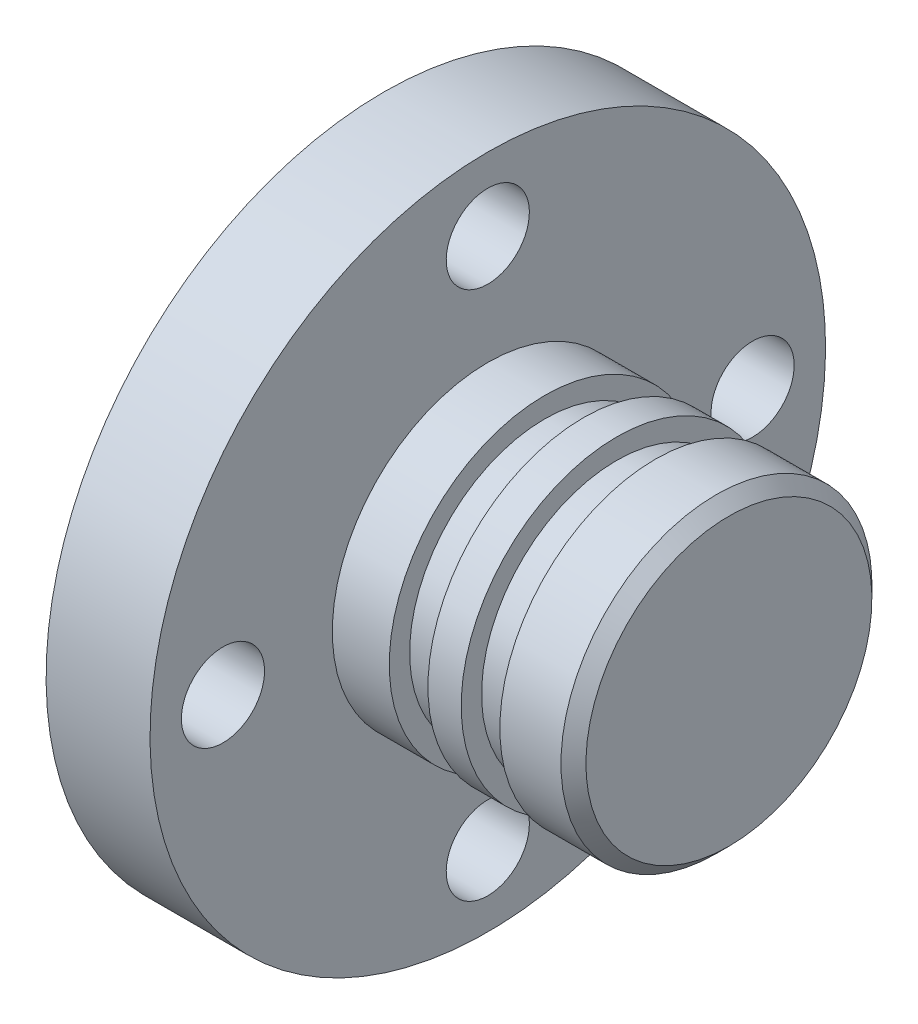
ISO-10303-21;
HEADER;
FILE_DESCRIPTION(('STEP AP214'),'2;1');
FILE_NAME('part.step','',(''),(''),'','','');
FILE_SCHEMA(('AUTOMOTIVE_DESIGN { 1 0 10303 214 1 1 1 1 }'));
ENDSEC;
DATA;
#1=APPLICATION_CONTEXT('core data for automotive mechanical design processes');
#2=APPLICATION_PROTOCOL_DEFINITION('international standard','automotive_design',2000,#1);
#3=PRODUCT_CONTEXT('',#1,'mechanical');
#4=PRODUCT('Part','Part','',(#3));
#5=PRODUCT_RELATED_PRODUCT_CATEGORY('part','',(#4));
#6=PRODUCT_DEFINITION_FORMATION('','',#4);
#7=PRODUCT_DEFINITION_CONTEXT('part definition',#1,'design');
#8=PRODUCT_DEFINITION('design','',#6,#7);
#9=PRODUCT_DEFINITION_SHAPE('','',#8);
#10=(LENGTH_UNIT() NAMED_UNIT(*) SI_UNIT(.MILLI.,.METRE.));
#11=(NAMED_UNIT(*) PLANE_ANGLE_UNIT() SI_UNIT($,.RADIAN.));
#12=(NAMED_UNIT(*) SI_UNIT($,.STERADIAN.) SOLID_ANGLE_UNIT());
#13=UNCERTAINTY_MEASURE_WITH_UNIT(LENGTH_MEASURE(1.E-05),#10,'distance_accuracy_value','');
#14=(GEOMETRIC_REPRESENTATION_CONTEXT(3) GLOBAL_UNCERTAINTY_ASSIGNED_CONTEXT((#13)) GLOBAL_UNIT_ASSIGNED_CONTEXT((#10,
#11,#12)) REPRESENTATION_CONTEXT('',''));
#15=CARTESIAN_POINT('',(0.,0.,0.));
#16=DIRECTION('',(0.,0.,1.));
#17=DIRECTION('',(1.,0.,0.));
#18=AXIS2_PLACEMENT_3D('',#15,#16,#17);
#19=CARTESIAN_POINT('',(0.,0.,0.));
#20=DIRECTION('',(1.,0.,0.));
#21=DIRECTION('',(0.,1.,0.));
#22=AXIS2_PLACEMENT_3D('',#19,#20,#21);
#23=CYLINDRICAL_SURFACE('',#22,9.4996);
#24=CARTESIAN_POINT('',(9.8298,0.,0.));
#25=DIRECTION('',(1.,0.,0.));
#26=DIRECTION('',(0.,1.,0.));
#27=AXIS2_PLACEMENT_3D('',#24,#25,#26);
#28=CIRCLE('',#27,9.4996);
#29=CARTESIAN_POINT('',(9.8298,9.4996,0.));
#30=VERTEX_POINT('',#29);
#31=EDGE_CURVE('E389',#30,#30,#28,.T.);
#32=ORIENTED_EDGE('',*,*,#31,.F.);
#33=EDGE_LOOP('',(#32));
#34=FACE_BOUND('',#33,.T.);
#35=CARTESIAN_POINT('',(6.35,0.,0.));
#36=DIRECTION('',(1.,0.,0.));
#37=DIRECTION('',(0.,1.,0.));
#38=AXIS2_PLACEMENT_3D('',#35,#36,#37);
#39=CIRCLE('',#38,9.4996);
#40=CARTESIAN_POINT('',(6.35,9.4996,0.));
#41=VERTEX_POINT('',#40);
#42=EDGE_CURVE('E411',#41,#41,#39,.T.);
#43=ORIENTED_EDGE('',*,*,#42,.T.);
#44=EDGE_LOOP('',(#43));
#45=FACE_BOUND('',#44,.T.);
#46=ADVANCED_FACE('F379',(#34,#45),#23,.T.);
#47=CARTESIAN_POINT('',(9.8298,-9.4996,0.));
#48=DIRECTION('',(-1.,0.,0.));
#49=DIRECTION('',(0.,-1.,0.));
#50=AXIS2_PLACEMENT_3D('',#47,#48,#49);
#51=PLANE('',#50);
#52=CARTESIAN_POINT('',(9.8298,0.,0.));
#53=DIRECTION('',(1.,0.,0.));
#54=DIRECTION('',(0.,1.,0.));
#55=AXIS2_PLACEMENT_3D('',#52,#53,#54);
#56=CIRCLE('',#55,8.255);
#57=CARTESIAN_POINT('',(9.8298,8.255,0.));
#58=VERTEX_POINT('',#57);
#59=EDGE_CURVE('E393',#58,#58,#56,.T.);
#60=ORIENTED_EDGE('',*,*,#59,.F.);
#61=EDGE_LOOP('',(#60));
#62=FACE_BOUND('',#61,.T.);
#63=ORIENTED_EDGE('',*,*,#31,.T.);
#64=EDGE_LOOP('',(#63));
#65=FACE_BOUND('',#64,.T.);
#66=ADVANCED_FACE('F481',(#62,#65),#51,.F.);
#67=CARTESIAN_POINT('',(0.,0.,0.));
#68=DIRECTION('',(1.,0.,0.));
#69=DIRECTION('',(0.,1.,0.));
#70=AXIS2_PLACEMENT_3D('',#67,#68,#69);
#71=CYLINDRICAL_SURFACE('',#70,8.255);
#72=CARTESIAN_POINT('',(12.192,0.,0.));
#73=DIRECTION('',(1.,0.,0.));
#74=DIRECTION('',(0.,1.,0.));
#75=AXIS2_PLACEMENT_3D('',#72,#73,#74);
#76=CIRCLE('',#75,8.255);
#77=CARTESIAN_POINT('',(12.192,8.255,0.));
#78=VERTEX_POINT('',#77);
#79=EDGE_CURVE('E415',#78,#78,#76,.T.);
#80=ORIENTED_EDGE('',*,*,#79,.F.);
#81=EDGE_LOOP('',(#80));
#82=FACE_BOUND('',#81,.T.);
#83=ORIENTED_EDGE('',*,*,#59,.T.);
#84=EDGE_LOOP('',(#83));
#85=FACE_BOUND('',#84,.T.);
#86=ADVANCED_FACE('F486',(#82,#85),#71,.T.);
#87=CARTESIAN_POINT('',(12.192,-8.255,0.));
#88=DIRECTION('',(1.,0.,0.));
#89=DIRECTION('',(0.,1.,0.));
#90=AXIS2_PLACEMENT_3D('',#87,#88,#89);
#91=PLANE('',#90);
#92=CARTESIAN_POINT('',(12.192,0.,0.));
#93=DIRECTION('',(1.,0.,0.));
#94=DIRECTION('',(0.,1.,0.));
#95=AXIS2_PLACEMENT_3D('',#92,#93,#94);
#96=CIRCLE('',#95,9.4996);
#97=CARTESIAN_POINT('',(12.192,9.4996,0.));
#98=VERTEX_POINT('',#97);
#99=EDGE_CURVE('E418',#98,#98,#96,.T.);
#100=ORIENTED_EDGE('',*,*,#99,.F.);
#101=EDGE_LOOP('',(#100));
#102=FACE_BOUND('',#101,.T.);
#103=ORIENTED_EDGE('',*,*,#79,.T.);
#104=EDGE_LOOP('',(#103));
#105=FACE_BOUND('',#104,.T.);
#106=ADVANCED_FACE('F497',(#102,#105),#91,.F.);
#107=CARTESIAN_POINT('',(0.,0.,0.));
#108=DIRECTION('',(1.,0.,0.));
#109=DIRECTION('',(0.,1.,0.));
#110=AXIS2_PLACEMENT_3D('',#107,#108,#109);
#111=CYLINDRICAL_SURFACE('',#110,9.4996);
#112=CARTESIAN_POINT('',(14.224,0.,0.));
#113=DIRECTION('',(1.,0.,0.));
#114=DIRECTION('',(0.,1.,0.));
#115=AXIS2_PLACEMENT_3D('',#112,#113,#114);
#116=CIRCLE('',#115,9.4996);
#117=CARTESIAN_POINT('',(14.224,9.4996,0.));
#118=VERTEX_POINT('',#117);
#119=EDGE_CURVE('E421',#118,#118,#116,.T.);
#120=ORIENTED_EDGE('',*,*,#119,.F.);
#121=EDGE_LOOP('',(#120));
#122=FACE_BOUND('',#121,.T.);
#123=ORIENTED_EDGE('',*,*,#99,.T.);
#124=EDGE_LOOP('',(#123));
#125=FACE_BOUND('',#124,.T.);
#126=ADVANCED_FACE('F504',(#122,#125),#111,.T.);
#127=CARTESIAN_POINT('',(14.224,-9.4996,0.));
#128=DIRECTION('',(-1.,0.,0.));
#129=DIRECTION('',(0.,-1.,0.));
#130=AXIS2_PLACEMENT_3D('',#127,#128,#129);
#131=PLANE('',#130);
#132=CARTESIAN_POINT('',(14.224,0.,0.));
#133=DIRECTION('',(1.,0.,0.));
#134=DIRECTION('',(0.,1.,0.));
#135=AXIS2_PLACEMENT_3D('',#132,#133,#134);
#136=CIRCLE('',#135,8.255);
#137=CARTESIAN_POINT('',(14.224,8.255,0.));
#138=VERTEX_POINT('',#137);
#139=EDGE_CURVE('E424',#138,#138,#136,.T.);
#140=ORIENTED_EDGE('',*,*,#139,.F.);
#141=EDGE_LOOP('',(#140));
#142=FACE_BOUND('',#141,.T.);
#143=ORIENTED_EDGE('',*,*,#119,.T.);
#144=EDGE_LOOP('',(#143));
#145=FACE_BOUND('',#144,.T.);
#146=ADVANCED_FACE('F508',(#142,#145),#131,.F.);
#147=CARTESIAN_POINT('',(0.,0.,0.));
#148=DIRECTION('',(1.,0.,0.));
#149=DIRECTION('',(0.,1.,0.));
#150=AXIS2_PLACEMENT_3D('',#147,#148,#149);
#151=CYLINDRICAL_SURFACE('',#150,8.255);
#152=CARTESIAN_POINT('',(16.5862,0.,0.));
#153=DIRECTION('',(1.,0.,0.));
#154=DIRECTION('',(0.,1.,0.));
#155=AXIS2_PLACEMENT_3D('',#152,#153,#154);
#156=CIRCLE('',#155,8.255);
#157=CARTESIAN_POINT('',(16.5862,8.255,0.));
#158=VERTEX_POINT('',#157);
#159=EDGE_CURVE('E427',#158,#158,#156,.T.);
#160=ORIENTED_EDGE('',*,*,#159,.F.);
#161=EDGE_LOOP('',(#160));
#162=FACE_BOUND('',#161,.T.);
#163=ORIENTED_EDGE('',*,*,#139,.T.);
#164=EDGE_LOOP('',(#163));
#165=FACE_BOUND('',#164,.T.);
#166=ADVANCED_FACE('F512',(#162,#165),#151,.T.);
#167=CARTESIAN_POINT('',(16.5862,-8.255,0.));
#168=DIRECTION('',(1.,0.,0.));
#169=DIRECTION('',(0.,1.,0.));
#170=AXIS2_PLACEMENT_3D('',#167,#168,#169);
#171=PLANE('',#170);
#172=CARTESIAN_POINT('',(16.5862,0.,0.));
#173=DIRECTION('',(1.,0.,0.));
#174=DIRECTION('',(0.,1.,0.));
#175=AXIS2_PLACEMENT_3D('',#172,#173,#174);
#176=CIRCLE('',#175,9.4996);
#177=CARTESIAN_POINT('',(16.5862,9.4996,0.));
#178=VERTEX_POINT('',#177);
#179=EDGE_CURVE('E430',#178,#178,#176,.T.);
#180=ORIENTED_EDGE('',*,*,#179,.F.);
#181=EDGE_LOOP('',(#180));
#182=FACE_BOUND('',#181,.T.);
#183=ORIENTED_EDGE('',*,*,#159,.T.);
#184=EDGE_LOOP('',(#183));
#185=FACE_BOUND('',#184,.T.);
#186=ADVANCED_FACE('F516',(#182,#185),#171,.F.);
#187=CARTESIAN_POINT('',(0.,0.,0.));
#188=DIRECTION('',(1.,0.,0.));
#189=DIRECTION('',(0.,1.,0.));
#190=AXIS2_PLACEMENT_3D('',#187,#188,#189);
#191=CYLINDRICAL_SURFACE('',#190,9.4996);
#192=CARTESIAN_POINT('',(20.32,0.,0.));
#193=DIRECTION('',(-1.,0.,0.));
#194=DIRECTION('',(0.,-1.,0.));
#195=AXIS2_PLACEMENT_3D('',#192,#193,#194);
#196=CIRCLE('',#195,9.4996);
#197=CARTESIAN_POINT('',(20.32,-9.4996,0.));
#198=VERTEX_POINT('',#197);
#199=EDGE_CURVE('E10',#198,#198,#196,.T.);
#200=ORIENTED_EDGE('',*,*,#199,.T.);
#201=EDGE_LOOP('',(#200));
#202=FACE_BOUND('',#201,.T.);
#203=ORIENTED_EDGE('',*,*,#179,.T.);
#204=EDGE_LOOP('',(#203));
#205=FACE_BOUND('',#204,.T.);
#206=ADVANCED_FACE('F519',(#202,#205),#191,.T.);
#207=CARTESIAN_POINT('',(21.082,0.,0.));
#208=DIRECTION('',(-1.,0.,0.));
#209=DIRECTION('',(0.,-1.,0.));
#210=AXIS2_PLACEMENT_3D('',#207,#208,#209);
#211=PLANE('',#210);
#212=CARTESIAN_POINT('',(21.082,0.,0.));
#213=DIRECTION('',(-1.,0.,0.));
#214=DIRECTION('',(0.,-1.,0.));
#215=AXIS2_PLACEMENT_3D('',#212,#213,#214);
#216=CIRCLE('',#215,8.73760000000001);
#217=CARTESIAN_POINT('',(21.082,-8.7376,0.));
#218=VERTEX_POINT('',#217);
#219=EDGE_CURVE('E385',#218,#218,#216,.F.);
#220=ORIENTED_EDGE('',*,*,#219,.T.);
#221=EDGE_LOOP('',(#220));
#222=FACE_BOUND('',#221,.T.);
#223=ADVANCED_FACE('F457',(#222),#211,.F.);
#224=CARTESIAN_POINT('',(0.,-20.6375,0.));
#225=DIRECTION('',(1.,0.,0.));
#226=DIRECTION('',(0.,1.,0.));
#227=AXIS2_PLACEMENT_3D('',#224,#225,#226);
#228=PLANE('',#227);
#229=CARTESIAN_POINT('',(0.,-16.1798,1.69474507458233E-13));
#230=DIRECTION('',(-1.,0.,0.));
#231=DIRECTION('',(0.,0.,-1.));
#232=AXIS2_PLACEMENT_3D('',#229,#230,#231);
#233=CIRCLE('',#232,2.54);
#234=CARTESIAN_POINT('',(0.,-16.1798,-2.53999999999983));
#235=VERTEX_POINT('',#234);
#236=EDGE_CURVE('E400',#235,#235,#233,.T.);
#237=ORIENTED_EDGE('',*,*,#236,.F.);
#238=EDGE_LOOP('',(#237));
#239=FACE_BOUND('',#238,.T.);
#240=CARTESIAN_POINT('',(0.,-1.12983004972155E-13,-16.1798));
#241=DIRECTION('',(-1.,0.,0.));
#242=DIRECTION('',(0.,1.,0.));
#243=AXIS2_PLACEMENT_3D('',#240,#241,#242);
#244=CIRCLE('',#243,2.54);
#245=CARTESIAN_POINT('',(0.,2.53999999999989,-16.1798));
#246=VERTEX_POINT('',#245);
#247=EDGE_CURVE('E399',#246,#246,#244,.T.);
#248=ORIENTED_EDGE('',*,*,#247,.F.);
#249=EDGE_LOOP('',(#248));
#250=FACE_BOUND('',#249,.T.);
#251=CARTESIAN_POINT('',(0.,16.1798,0.));
#252=DIRECTION('',(-1.,0.,0.));
#253=DIRECTION('',(0.,0.,1.));
#254=AXIS2_PLACEMENT_3D('',#251,#252,#253);
#255=CIRCLE('',#254,2.54);
#256=CARTESIAN_POINT('',(0.,16.1798,2.53999999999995));
#257=VERTEX_POINT('',#256);
#258=EDGE_CURVE('E404',#257,#257,#255,.T.);
#259=ORIENTED_EDGE('',*,*,#258,.F.);
#260=EDGE_LOOP('',(#259));
#261=FACE_BOUND('',#260,.T.);
#262=CARTESIAN_POINT('',(0.,0.,16.1798));
#263=DIRECTION('',(-1.,0.,0.));
#264=DIRECTION('',(0.,-1.,0.));
#265=AXIS2_PLACEMENT_3D('',#262,#263,#264);
#266=CIRCLE('',#265,2.54);
#267=CARTESIAN_POINT('',(0.,-2.54,16.1798));
#268=VERTEX_POINT('',#267);
#269=EDGE_CURVE('E408',#268,#268,#266,.T.);
#270=ORIENTED_EDGE('',*,*,#269,.F.);
#271=EDGE_LOOP('',(#270));
#272=FACE_BOUND('',#271,.T.);
#273=CARTESIAN_POINT('',(0.,0.,0.));
#274=DIRECTION('',(1.,0.,0.));
#275=DIRECTION('',(0.,1.,0.));
#276=AXIS2_PLACEMENT_3D('',#273,#274,#275);
#277=CIRCLE('',#276,20.6375);
#278=CARTESIAN_POINT('',(0.,20.6375,0.));
#279=VERTEX_POINT('',#278);
#280=EDGE_CURVE('E433',#279,#279,#277,.T.);
#281=ORIENTED_EDGE('',*,*,#280,.F.);
#282=EDGE_LOOP('',(#281));
#283=FACE_BOUND('',#282,.T.);
#284=ADVANCED_FACE('F453',(#239,#250,#261,#272,#283),#228,.F.);
#285=CARTESIAN_POINT('',(0.,0.,0.));
#286=DIRECTION('',(1.,0.,0.));
#287=DIRECTION('',(0.,1.,0.));
#288=AXIS2_PLACEMENT_3D('',#285,#286,#287);
#289=CYLINDRICAL_SURFACE('',#288,20.6375);
#290=CARTESIAN_POINT('',(6.35,0.,0.));
#291=DIRECTION('',(1.,0.,0.));
#292=DIRECTION('',(0.,1.,0.));
#293=AXIS2_PLACEMENT_3D('',#290,#291,#292);
#294=CIRCLE('',#293,20.6375);
#295=CARTESIAN_POINT('',(6.34999999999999,20.6375,0.));
#296=VERTEX_POINT('',#295);
#297=EDGE_CURVE('E436',#296,#296,#294,.T.);
#298=ORIENTED_EDGE('',*,*,#297,.F.);
#299=EDGE_LOOP('',(#298));
#300=FACE_BOUND('',#299,.T.);
#301=ORIENTED_EDGE('',*,*,#280,.T.);
#302=EDGE_LOOP('',(#301));
#303=FACE_BOUND('',#302,.T.);
#304=ADVANCED_FACE('F456',(#300,#303),#289,.T.);
#305=CARTESIAN_POINT('',(6.35,-9.4996,0.));
#306=DIRECTION('',(-1.,0.,0.));
#307=DIRECTION('',(0.,-1.,0.));
#308=AXIS2_PLACEMENT_3D('',#305,#306,#307);
#309=PLANE('',#308);
#310=CARTESIAN_POINT('',(6.35,-16.1798,1.69474507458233E-13));
#311=DIRECTION('',(-1.,0.,0.));
#312=DIRECTION('',(0.,-1.,0.));
#313=AXIS2_PLACEMENT_3D('',#310,#311,#312);
#314=CIRCLE('',#313,2.54);
#315=CARTESIAN_POINT('',(6.35,-18.7198,1.69474507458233E-13));
#316=VERTEX_POINT('',#315);
#317=EDGE_CURVE('E396',#316,#316,#314,.T.);
#318=ORIENTED_EDGE('',*,*,#317,.T.);
#319=EDGE_LOOP('',(#318));
#320=FACE_BOUND('',#319,.T.);
#321=CARTESIAN_POINT('',(6.35,-1.12098073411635E-13,-16.1798));
#322=DIRECTION('',(-1.,0.,0.));
#323=DIRECTION('',(0.,-1.,0.));
#324=AXIS2_PLACEMENT_3D('',#321,#322,#323);
#325=CIRCLE('',#324,2.54);
#326=CARTESIAN_POINT('',(6.35,-2.54000000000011,-16.1798));
#327=VERTEX_POINT('',#326);
#328=EDGE_CURVE('E401',#327,#327,#325,.T.);
#329=ORIENTED_EDGE('',*,*,#328,.T.);
#330=EDGE_LOOP('',(#329));
#331=FACE_BOUND('',#330,.T.);
#332=CARTESIAN_POINT('',(6.34999999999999,16.1798,0.));
#333=DIRECTION('',(-1.,0.,0.));
#334=DIRECTION('',(0.,-1.,0.));
#335=AXIS2_PLACEMENT_3D('',#332,#333,#334);
#336=CIRCLE('',#335,2.54);
#337=CARTESIAN_POINT('',(6.34999999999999,13.6398,0.));
#338=VERTEX_POINT('',#337);
#339=EDGE_CURVE('E405',#338,#338,#336,.T.);
#340=ORIENTED_EDGE('',*,*,#339,.T.);
#341=EDGE_LOOP('',(#340));
#342=FACE_BOUND('',#341,.T.);
#343=CARTESIAN_POINT('',(6.35,0.,16.1798));
#344=DIRECTION('',(-1.,0.,0.));
#345=DIRECTION('',(0.,-1.,0.));
#346=AXIS2_PLACEMENT_3D('',#343,#344,#345);
#347=CIRCLE('',#346,2.54);
#348=CARTESIAN_POINT('',(6.35,-2.54,16.1798));
#349=VERTEX_POINT('',#348);
#350=EDGE_CURVE('E409',#349,#349,#347,.T.);
#351=ORIENTED_EDGE('',*,*,#350,.T.);
#352=EDGE_LOOP('',(#351));
#353=FACE_BOUND('',#352,.T.);
#354=ORIENTED_EDGE('',*,*,#42,.F.);
#355=EDGE_LOOP('',(#354));
#356=FACE_BOUND('',#355,.T.);
#357=ORIENTED_EDGE('',*,*,#297,.T.);
#358=EDGE_LOOP('',(#357));
#359=FACE_BOUND('',#358,.T.);
#360=ADVANCED_FACE('F468',(#320,#331,#342,#353,#356,#359),#309,.F.);
#361=CARTESIAN_POINT('',(21.082,0.,16.1798));
#362=DIRECTION('',(-1.,0.,0.));
#363=DIRECTION('',(0.,-1.,0.));
#364=AXIS2_PLACEMENT_3D('',#361,#362,#363);
#365=CYLINDRICAL_SURFACE('',#364,2.54);
#366=ORIENTED_EDGE('',*,*,#269,.T.);
#367=EDGE_LOOP('',(#366));
#368=FACE_BOUND('',#367,.T.);
#369=ORIENTED_EDGE('',*,*,#350,.F.);
#370=EDGE_LOOP('',(#369));
#371=FACE_BOUND('',#370,.T.);
#372=ADVANCED_FACE('F476',(#368,#371),#365,.F.);
#373=CARTESIAN_POINT('',(21.082,16.1798,0.));
#374=DIRECTION('',(-1.,0.,0.));
#375=DIRECTION('',(0.,-1.,0.));
#376=AXIS2_PLACEMENT_3D('',#373,#374,#375);
#377=CYLINDRICAL_SURFACE('',#376,2.54);
#378=ORIENTED_EDGE('',*,*,#258,.T.);
#379=EDGE_LOOP('',(#378));
#380=FACE_BOUND('',#379,.T.);
#381=ORIENTED_EDGE('',*,*,#339,.F.);
#382=EDGE_LOOP('',(#381));
#383=FACE_BOUND('',#382,.T.);
#384=ADVANCED_FACE('F551',(#380,#383),#377,.F.);
#385=CARTESIAN_POINT('',(21.082,-1.10045032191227E-13,-16.1798));
#386=DIRECTION('',(-1.,0.,0.));
#387=DIRECTION('',(0.,-1.,0.));
#388=AXIS2_PLACEMENT_3D('',#385,#386,#387);
#389=CYLINDRICAL_SURFACE('',#388,2.54);
#390=ORIENTED_EDGE('',*,*,#247,.T.);
#391=EDGE_LOOP('',(#390));
#392=FACE_BOUND('',#391,.T.);
#393=ORIENTED_EDGE('',*,*,#328,.F.);
#394=EDGE_LOOP('',(#393));
#395=FACE_BOUND('',#394,.T.);
#396=ADVANCED_FACE('F544',(#392,#395),#389,.F.);
#397=CARTESIAN_POINT('',(21.082,-16.1798,1.69474507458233E-13));
#398=DIRECTION('',(-1.,0.,0.));
#399=DIRECTION('',(0.,-1.,0.));
#400=AXIS2_PLACEMENT_3D('',#397,#398,#399);
#401=CYLINDRICAL_SURFACE('',#400,2.54);
#402=ORIENTED_EDGE('',*,*,#236,.T.);
#403=EDGE_LOOP('',(#402));
#404=FACE_BOUND('',#403,.T.);
#405=ORIENTED_EDGE('',*,*,#317,.F.);
#406=EDGE_LOOP('',(#405));
#407=FACE_BOUND('',#406,.T.);
#408=ADVANCED_FACE('F450',(#404,#407),#401,.F.);
#409=CARTESIAN_POINT('',(21.082,0.,0.));
#410=DIRECTION('',(-1.,0.,0.));
#411=DIRECTION('',(0.,-1.,0.));
#412=AXIS2_PLACEMENT_3D('',#409,#410,#411);
#413=CONICAL_SURFACE('',#412,8.73760000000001,0.785398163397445);
#414=ORIENTED_EDGE('',*,*,#199,.F.);
#415=EDGE_LOOP('',(#414));
#416=FACE_BOUND('',#415,.T.);
#417=ORIENTED_EDGE('',*,*,#219,.F.);
#418=EDGE_LOOP('',(#417));
#419=FACE_BOUND('',#418,.T.);
#420=ADVANCED_FACE('F533',(#416,#419),#413,.T.);
#421=CLOSED_SHELL('',(#46,#66,#86,#106,#126,#146,#166,#186,#206,#223,#284,#304,#360,#372,#384,
#396,#408,#420));
#422=MANIFOLD_SOLID_BREP('B2',#421);
#423=ADVANCED_BREP_SHAPE_REPRESENTATION('',(#18,#422),#14);
#424=SHAPE_DEFINITION_REPRESENTATION(#9,#423);
ENDSEC;
END-ISO-10303-21;
